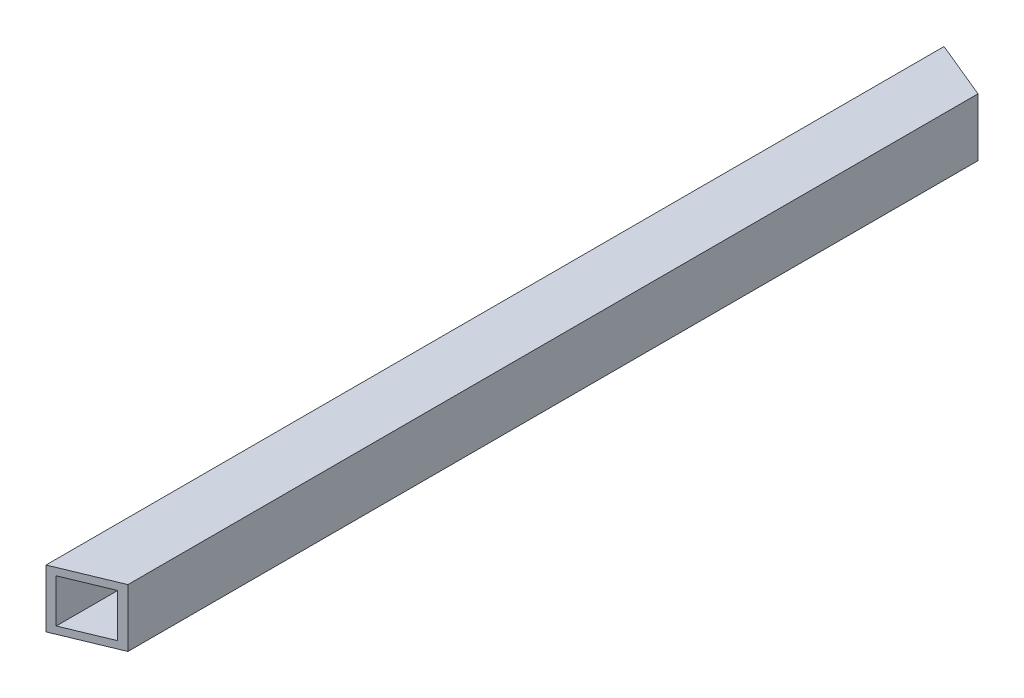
ISO-10303-21;
HEADER;
FILE_DESCRIPTION(('STEP AP214'),'2;1');
FILE_NAME('part.step','',(''),(''),'','','');
FILE_SCHEMA(('AUTOMOTIVE_DESIGN { 1 0 10303 214 1 1 1 1 }'));
ENDSEC;
DATA;
#1=APPLICATION_CONTEXT('core data for automotive mechanical design processes');
#2=APPLICATION_PROTOCOL_DEFINITION('international standard','automotive_design',2000,#1);
#3=PRODUCT_CONTEXT('',#1,'mechanical');
#4=PRODUCT('Part','Part','',(#3));
#5=PRODUCT_RELATED_PRODUCT_CATEGORY('part','',(#4));
#6=PRODUCT_DEFINITION_FORMATION('','',#4);
#7=PRODUCT_DEFINITION_CONTEXT('part definition',#1,'design');
#8=PRODUCT_DEFINITION('design','',#6,#7);
#9=PRODUCT_DEFINITION_SHAPE('','',#8);
#10=(LENGTH_UNIT() NAMED_UNIT(*) SI_UNIT(.MILLI.,.METRE.));
#11=(NAMED_UNIT(*) PLANE_ANGLE_UNIT() SI_UNIT($,.RADIAN.));
#12=(NAMED_UNIT(*) SI_UNIT($,.STERADIAN.) SOLID_ANGLE_UNIT());
#13=UNCERTAINTY_MEASURE_WITH_UNIT(LENGTH_MEASURE(1.E-05),#10,'distance_accuracy_value','');
#14=(GEOMETRIC_REPRESENTATION_CONTEXT(3) GLOBAL_UNCERTAINTY_ASSIGNED_CONTEXT((#13)) GLOBAL_UNIT_ASSIGNED_CONTEXT((#10,
#11,#12)) REPRESENTATION_CONTEXT('',''));
#15=CARTESIAN_POINT('',(0.,0.,0.));
#16=DIRECTION('',(0.,0.,1.));
#17=DIRECTION('',(1.,0.,0.));
#18=AXIS2_PLACEMENT_3D('',#15,#16,#17);
#19=CARTESIAN_POINT('',(-9.525,-9.525,196.85));
#20=DIRECTION('',(0.,1.,0.));
#21=DIRECTION('',(0.,0.,1.));
#22=AXIS2_PLACEMENT_3D('',#19,#20,#21);
#23=PLANE('',#22);
#24=DIRECTION('',(0.,0.,-1.));
#25=VECTOR('',#24,1.);
#26=CARTESIAN_POINT('',(-9.525,-9.525,196.85));
#27=LINE('',#26,#25);
#28=CARTESIAN_POINT('',(-9.525,-9.525,195.534871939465));
#29=VERTEX_POINT('',#28);
#30=CARTESIAN_POINT('',(-9.525,-9.525,-195.534871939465));
#31=VERTEX_POINT('',#30);
#32=EDGE_CURVE('E132',#29,#31,#27,.T.);
#33=ORIENTED_EDGE('',*,*,#32,.F.);
#34=DIRECTION('',(0.923879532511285,0.,-0.382683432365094));
#35=VECTOR('',#34,1.);
#36=CARTESIAN_POINT('',(-9.98996798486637,-9.525,195.727467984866));
#37=LINE('',#36,#35);
#38=CARTESIAN_POINT('',(9.525,-9.525,187.644103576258));
#39=VERTEX_POINT('',#38);
#40=EDGE_CURVE('E12',#29,#39,#37,.T.);
#41=ORIENTED_EDGE('',*,*,#40,.T.);
#42=DIRECTION('',(0.,0.,-1.));
#43=VECTOR('',#42,1.);
#44=CARTESIAN_POINT('',(9.525,-9.525,196.85));
#45=LINE('',#44,#43);
#46=CARTESIAN_POINT('',(9.52500000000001,-9.525,-187.644103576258));
#47=VERTEX_POINT('',#46);
#48=EDGE_CURVE('E134',#39,#47,#45,.T.);
#49=ORIENTED_EDGE('',*,*,#48,.T.);
#50=DIRECTION('',(-0.923879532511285,0.,-0.382683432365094));
#51=VECTOR('',#50,1.);
#52=CARTESIAN_POINT('',(129.204001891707,-9.525,-138.071437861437));
#53=LINE('',#52,#51);
#54=EDGE_CURVE('E40',#47,#31,#53,.T.);
#55=ORIENTED_EDGE('',*,*,#54,.T.);
#56=EDGE_LOOP('',(#33,#41,#49,#55));
#57=FACE_BOUND('',#56,.T.);
#58=ADVANCED_FACE('F32',(#57),#23,.T.);
#59=CARTESIAN_POINT('',(-9.525,-9.525,196.85));
#60=DIRECTION('',(1.,0.,0.));
#61=DIRECTION('',(0.,0.,-1.));
#62=AXIS2_PLACEMENT_3D('',#59,#60,#61);
#63=PLANE('',#62);
#64=DIRECTION('',(0.,0.,-1.));
#65=VECTOR('',#64,1.);
#66=CARTESIAN_POINT('',(-9.525,9.525,196.85));
#67=LINE('',#66,#65);
#68=CARTESIAN_POINT('',(-9.525,9.525,195.534871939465));
#69=VERTEX_POINT('',#68);
#70=CARTESIAN_POINT('',(-9.525,9.525,-195.534871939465));
#71=VERTEX_POINT('',#70);
#72=EDGE_CURVE('E144',#69,#71,#67,.T.);
#73=ORIENTED_EDGE('',*,*,#72,.F.);
#74=DIRECTION('',(0.,-1.,0.));
#75=VECTOR('',#74,1.);
#76=CARTESIAN_POINT('',(-9.525,-9.525,195.534871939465));
#77=LINE('',#76,#75);
#78=EDGE_CURVE('E143',#69,#29,#77,.T.);
#79=ORIENTED_EDGE('',*,*,#78,.T.);
#80=ORIENTED_EDGE('',*,*,#32,.T.);
#81=DIRECTION('',(0.,1.,0.));
#82=VECTOR('',#81,1.);
#83=CARTESIAN_POINT('',(-9.525,-9.525,-195.534871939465));
#84=LINE('',#83,#82);
#85=EDGE_CURVE('E114',#31,#71,#84,.T.);
#86=ORIENTED_EDGE('',*,*,#85,.T.);
#87=EDGE_LOOP('',(#73,#79,#80,#86));
#88=FACE_BOUND('',#87,.T.);
#89=ADVANCED_FACE('F141',(#88),#63,.T.);
#90=CARTESIAN_POINT('',(-9.525,9.525,196.85));
#91=DIRECTION('',(0.,-1.,0.));
#92=DIRECTION('',(0.,0.,-1.));
#93=AXIS2_PLACEMENT_3D('',#90,#91,#92);
#94=PLANE('',#93);
#95=DIRECTION('',(0.,0.,-1.));
#96=VECTOR('',#95,1.);
#97=CARTESIAN_POINT('',(9.525,9.525,196.85));
#98=LINE('',#97,#96);
#99=CARTESIAN_POINT('',(9.525,9.525,187.644103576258));
#100=VERTEX_POINT('',#99);
#101=CARTESIAN_POINT('',(9.52500000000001,9.525,-187.644103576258));
#102=VERTEX_POINT('',#101);
#103=EDGE_CURVE('E146',#100,#102,#98,.T.);
#104=ORIENTED_EDGE('',*,*,#103,.F.);
#105=DIRECTION('',(-0.923879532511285,0.,0.382683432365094));
#106=VECTOR('',#105,1.);
#107=CARTESIAN_POINT('',(-9.98996798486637,9.525,195.727467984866));
#108=LINE('',#107,#106);
#109=EDGE_CURVE('E176',#100,#69,#108,.T.);
#110=ORIENTED_EDGE('',*,*,#109,.T.);
#111=ORIENTED_EDGE('',*,*,#72,.T.);
#112=DIRECTION('',(0.923879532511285,0.,0.382683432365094));
#113=VECTOR('',#112,1.);
#114=CARTESIAN_POINT('',(129.204001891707,9.525,-138.071437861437));
#115=LINE('',#114,#113);
#116=EDGE_CURVE('E170',#71,#102,#115,.T.);
#117=ORIENTED_EDGE('',*,*,#116,.T.);
#118=EDGE_LOOP('',(#104,#110,#111,#117));
#119=FACE_BOUND('',#118,.T.);
#120=ADVANCED_FACE('F180',(#119),#94,.T.);
#121=CARTESIAN_POINT('',(9.525,-9.525,196.85));
#122=DIRECTION('',(-1.,0.,0.));
#123=DIRECTION('',(0.,0.,1.));
#124=AXIS2_PLACEMENT_3D('',#121,#122,#123);
#125=PLANE('',#124);
#126=ORIENTED_EDGE('',*,*,#48,.F.);
#127=DIRECTION('',(0.,1.,0.));
#128=VECTOR('',#127,1.);
#129=CARTESIAN_POINT('',(9.525,-9.525,187.644103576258));
#130=LINE('',#129,#128);
#131=EDGE_CURVE('E55',#39,#100,#130,.T.);
#132=ORIENTED_EDGE('',*,*,#131,.T.);
#133=ORIENTED_EDGE('',*,*,#103,.T.);
#134=DIRECTION('',(0.,-1.,0.));
#135=VECTOR('',#134,1.);
#136=CARTESIAN_POINT('',(9.525,-9.525,-187.644103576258));
#137=LINE('',#136,#135);
#138=EDGE_CURVE('E173',#102,#47,#137,.T.);
#139=ORIENTED_EDGE('',*,*,#138,.T.);
#140=EDGE_LOOP('',(#126,#132,#133,#139));
#141=FACE_BOUND('',#140,.T.);
#142=ADVANCED_FACE('F178',(#141),#125,.T.);
#143=CARTESIAN_POINT('',(12.7,-12.7,-186.328975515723));
#144=DIRECTION('',(0.382683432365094,0.,-0.923879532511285));
#145=DIRECTION('',(-0.923879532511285,0.,-0.382683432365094));
#146=AXIS2_PLACEMENT_3D('',#143,#144,#145);
#147=PLANE('',#146);
#148=ORIENTED_EDGE('',*,*,#116,.F.);
#149=ORIENTED_EDGE('',*,*,#85,.F.);
#150=ORIENTED_EDGE('',*,*,#54,.F.);
#151=ORIENTED_EDGE('',*,*,#138,.F.);
#152=EDGE_LOOP('',(#148,#149,#150,#151));
#153=FACE_BOUND('',#152,.T.);
#154=DIRECTION('',(-0.923879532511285,0.,-0.382683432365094));
#155=VECTOR('',#154,1.);
#156=CARTESIAN_POINT('',(12.7,12.7,-186.328975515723));
#157=LINE('',#156,#155);
#158=CARTESIAN_POINT('',(12.7,12.7,-186.328975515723));
#159=VERTEX_POINT('',#158);
#160=CARTESIAN_POINT('',(-12.7,12.7,-196.85));
#161=VERTEX_POINT('',#160);
#162=EDGE_CURVE('E160',#159,#161,#157,.T.);
#163=ORIENTED_EDGE('',*,*,#162,.F.);
#164=DIRECTION('',(0.,1.,0.));
#165=VECTOR('',#164,1.);
#166=CARTESIAN_POINT('',(12.7,-12.7,-186.328975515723));
#167=LINE('',#166,#165);
#168=CARTESIAN_POINT('',(12.7,-12.7,-186.328975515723));
#169=VERTEX_POINT('',#168);
#170=EDGE_CURVE('E47',#169,#159,#167,.T.);
#171=ORIENTED_EDGE('',*,*,#170,.F.);
#172=DIRECTION('',(-0.923879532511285,0.,-0.382683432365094));
#173=VECTOR('',#172,1.);
#174=CARTESIAN_POINT('',(12.7,-12.7,-186.328975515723));
#175=LINE('',#174,#173);
#176=CARTESIAN_POINT('',(-12.7,-12.7,-196.85));
#177=VERTEX_POINT('',#176);
#178=EDGE_CURVE('E106',#169,#177,#175,.T.);
#179=ORIENTED_EDGE('',*,*,#178,.T.);
#180=DIRECTION('',(0.,-1.,0.));
#181=VECTOR('',#180,1.);
#182=CARTESIAN_POINT('',(-12.7,-12.7,-196.85));
#183=LINE('',#182,#181);
#184=EDGE_CURVE('E121',#161,#177,#183,.T.);
#185=ORIENTED_EDGE('',*,*,#184,.F.);
#186=EDGE_LOOP('',(#163,#171,#179,#185));
#187=FACE_BOUND('',#186,.T.);
#188=ADVANCED_FACE('F159',(#153,#187),#147,.T.);
#189=CARTESIAN_POINT('',(-12.7,-12.7,196.85));
#190=DIRECTION('',(0.382683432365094,0.,0.923879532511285));
#191=DIRECTION('',(0.923879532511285,0.,-0.382683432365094));
#192=AXIS2_PLACEMENT_3D('',#189,#190,#191);
#193=PLANE('',#192);
#194=ORIENTED_EDGE('',*,*,#40,.F.);
#195=ORIENTED_EDGE('',*,*,#78,.F.);
#196=ORIENTED_EDGE('',*,*,#109,.F.);
#197=ORIENTED_EDGE('',*,*,#131,.F.);
#198=EDGE_LOOP('',(#194,#195,#196,#197));
#199=FACE_BOUND('',#198,.T.);
#200=DIRECTION('',(0.923879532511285,0.,-0.382683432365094));
#201=VECTOR('',#200,1.);
#202=CARTESIAN_POINT('',(-12.7,12.7,196.85));
#203=LINE('',#202,#201);
#204=CARTESIAN_POINT('',(-12.7,12.7,196.85));
#205=VERTEX_POINT('',#204);
#206=CARTESIAN_POINT('',(12.7,12.7,186.328975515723));
#207=VERTEX_POINT('',#206);
#208=EDGE_CURVE('E163',#205,#207,#203,.T.);
#209=ORIENTED_EDGE('',*,*,#208,.F.);
#210=DIRECTION('',(0.,-1.,0.));
#211=VECTOR('',#210,1.);
#212=CARTESIAN_POINT('',(-12.7,-12.7,196.85));
#213=LINE('',#212,#211);
#214=CARTESIAN_POINT('',(-12.7,-12.7,196.85));
#215=VERTEX_POINT('',#214);
#216=EDGE_CURVE('E101',#205,#215,#213,.T.);
#217=ORIENTED_EDGE('',*,*,#216,.T.);
#218=DIRECTION('',(0.923879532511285,0.,-0.382683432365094));
#219=VECTOR('',#218,1.);
#220=CARTESIAN_POINT('',(-12.7,-12.7,196.85));
#221=LINE('',#220,#219);
#222=CARTESIAN_POINT('',(12.7,-12.7,186.328975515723));
#223=VERTEX_POINT('',#222);
#224=EDGE_CURVE('E95',#215,#223,#221,.T.);
#225=ORIENTED_EDGE('',*,*,#224,.T.);
#226=DIRECTION('',(0.,1.,0.));
#227=VECTOR('',#226,1.);
#228=CARTESIAN_POINT('',(12.7,-12.7,186.328975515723));
#229=LINE('',#228,#227);
#230=EDGE_CURVE('E98',#223,#207,#229,.T.);
#231=ORIENTED_EDGE('',*,*,#230,.T.);
#232=EDGE_LOOP('',(#209,#217,#225,#231));
#233=FACE_BOUND('',#232,.T.);
#234=ADVANCED_FACE('F97',(#199,#233),#193,.T.);
#235=CARTESIAN_POINT('',(12.7,-12.7,196.85));
#236=DIRECTION('',(-1.,0.,0.));
#237=DIRECTION('',(0.,0.,1.));
#238=AXIS2_PLACEMENT_3D('',#235,#236,#237);
#239=PLANE('',#238);
#240=ORIENTED_EDGE('',*,*,#230,.F.);
#241=DIRECTION('',(0.,0.,-1.));
#242=VECTOR('',#241,1.);
#243=CARTESIAN_POINT('',(12.7,-12.7,196.85));
#244=LINE('',#243,#242);
#245=EDGE_CURVE('E111',#223,#169,#244,.T.);
#246=ORIENTED_EDGE('',*,*,#245,.T.);
#247=ORIENTED_EDGE('',*,*,#170,.T.);
#248=DIRECTION('',(0.,0.,-1.));
#249=VECTOR('',#248,1.);
#250=CARTESIAN_POINT('',(12.7,12.7,196.85));
#251=LINE('',#250,#249);
#252=EDGE_CURVE('E113',#207,#159,#251,.T.);
#253=ORIENTED_EDGE('',*,*,#252,.F.);
#254=EDGE_LOOP('',(#240,#246,#247,#253));
#255=FACE_BOUND('',#254,.T.);
#256=ADVANCED_FACE('F34',(#255),#239,.F.);
#257=CARTESIAN_POINT('',(-12.7,12.7,196.85));
#258=DIRECTION('',(0.,-1.,0.));
#259=DIRECTION('',(0.,0.,-1.));
#260=AXIS2_PLACEMENT_3D('',#257,#258,#259);
#261=PLANE('',#260);
#262=ORIENTED_EDGE('',*,*,#208,.T.);
#263=ORIENTED_EDGE('',*,*,#252,.T.);
#264=ORIENTED_EDGE('',*,*,#162,.T.);
#265=DIRECTION('',(0.,0.,-1.));
#266=VECTOR('',#265,1.);
#267=CARTESIAN_POINT('',(-12.7,12.7,196.85));
#268=LINE('',#267,#266);
#269=EDGE_CURVE('E119',#205,#161,#268,.T.);
#270=ORIENTED_EDGE('',*,*,#269,.F.);
#271=EDGE_LOOP('',(#262,#263,#264,#270));
#272=FACE_BOUND('',#271,.T.);
#273=ADVANCED_FACE('F162',(#272),#261,.F.);
#274=CARTESIAN_POINT('',(-12.7,-12.7,196.85));
#275=DIRECTION('',(0.,1.,0.));
#276=DIRECTION('',(0.,0.,1.));
#277=AXIS2_PLACEMENT_3D('',#274,#275,#276);
#278=PLANE('',#277);
#279=ORIENTED_EDGE('',*,*,#224,.F.);
#280=DIRECTION('',(0.,0.,-1.));
#281=VECTOR('',#280,1.);
#282=CARTESIAN_POINT('',(-12.7,-12.7,196.85));
#283=LINE('',#282,#281);
#284=EDGE_CURVE('E117',#215,#177,#283,.T.);
#285=ORIENTED_EDGE('',*,*,#284,.T.);
#286=ORIENTED_EDGE('',*,*,#178,.F.);
#287=ORIENTED_EDGE('',*,*,#245,.F.);
#288=EDGE_LOOP('',(#279,#285,#286,#287));
#289=FACE_BOUND('',#288,.T.);
#290=ADVANCED_FACE('F116',(#289),#278,.F.);
#291=CARTESIAN_POINT('',(-12.7,-12.7,196.85));
#292=DIRECTION('',(1.,0.,0.));
#293=DIRECTION('',(0.,0.,-1.));
#294=AXIS2_PLACEMENT_3D('',#291,#292,#293);
#295=PLANE('',#294);
#296=ORIENTED_EDGE('',*,*,#184,.T.);
#297=ORIENTED_EDGE('',*,*,#284,.F.);
#298=ORIENTED_EDGE('',*,*,#216,.F.);
#299=ORIENTED_EDGE('',*,*,#269,.T.);
#300=EDGE_LOOP('',(#296,#297,#298,#299));
#301=FACE_BOUND('',#300,.T.);
#302=ADVANCED_FACE('F156',(#301),#295,.F.);
#303=CLOSED_SHELL('',(#58,#89,#120,#142,#188,#234,#256,#273,#290,#302));
#304=MANIFOLD_SOLID_BREP('B2',#303);
#305=ADVANCED_BREP_SHAPE_REPRESENTATION('',(#18,#304),#14);
#306=SHAPE_DEFINITION_REPRESENTATION(#9,#305);
ENDSEC;
END-ISO-10303-21;
